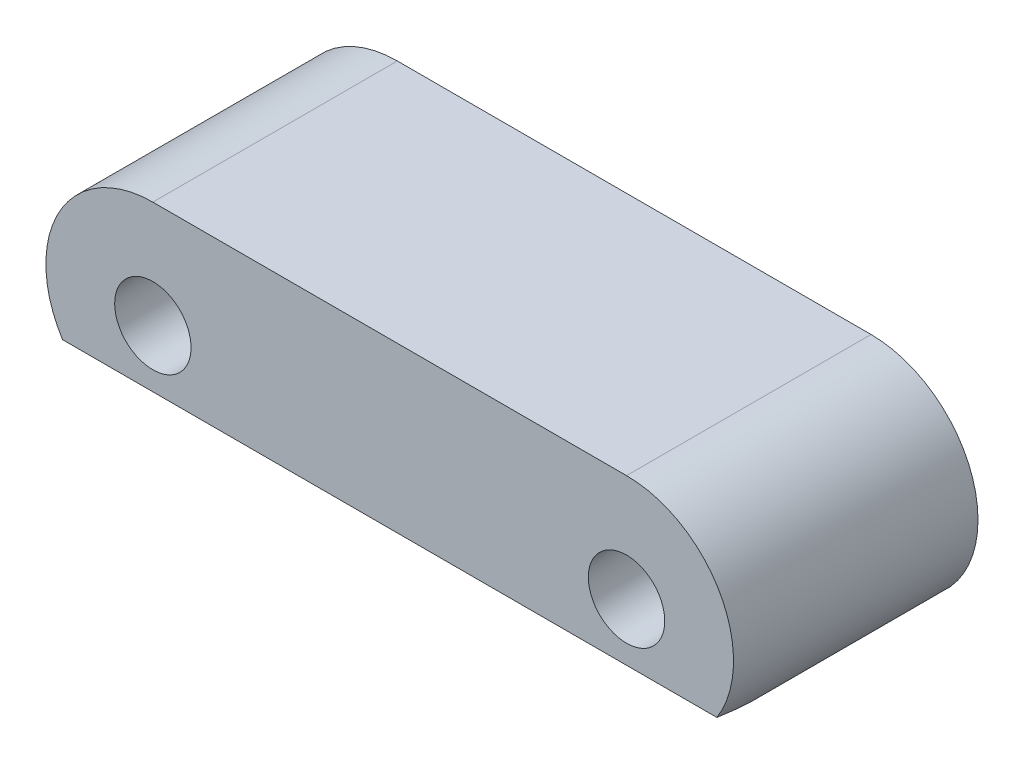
from build123d import *

# Parameters (mm, degrees)
EXTRUSION1_DEPTH             = 16
ENL_V_MAT_EXTRU_1_DEPTH      = 42.821047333
ENL_V_MAT_EXTRU_1_DEPTH_BACK = 42.821047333
TROU_TARAUD_M6X1_01_D        = 5


with BuildPart() as part:
    # Esquisse1 → Extrusion1 (new body)
    with BuildSketch(Plane.XY):
        with BuildLine():
            Line((0, 7), (31, 7))
            ThreePointArc((31, 7), (38, 0), (31, -7))
            Line((31, -7), (0, -7))
            ThreePointArc((0, -7), (-7, 0), (0, 7))
        make_face()
    extrude(amount=EXTRUSION1_DEPTH)

    # Esquisse2 → Enl_v. mat.-Extru.1 (cut, two sides: drawn at the far end of the back side and taken through both)
    with BuildSketch(Plane(origin=(0, 0, 0), x_dir=(0, 0, -1), z_dir=(1, 0, 0)).offset(-ENL_V_MAT_EXTRU_1_DEPTH_BACK)):
        Polygon((-6, -7), (-16, -3.750803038), (-16, -7), align=None)
    extrude(amount=ENL_V_MAT_EXTRU_1_DEPTH + ENL_V_MAT_EXTRU_1_DEPTH_BACK, mode=Mode.SUBTRACT)

    # Trou taraud_ M6x1.01 (through all)
    with Locations(Plane(origin=(0, 0, 0), x_dir=(-1, 0, 0), z_dir=(0, 0, -1))):
        with Locations((-31, 0), (0, 0)):
            Hole(TROU_TARAUD_M6X1_01_D / 2)


solid = part.part
